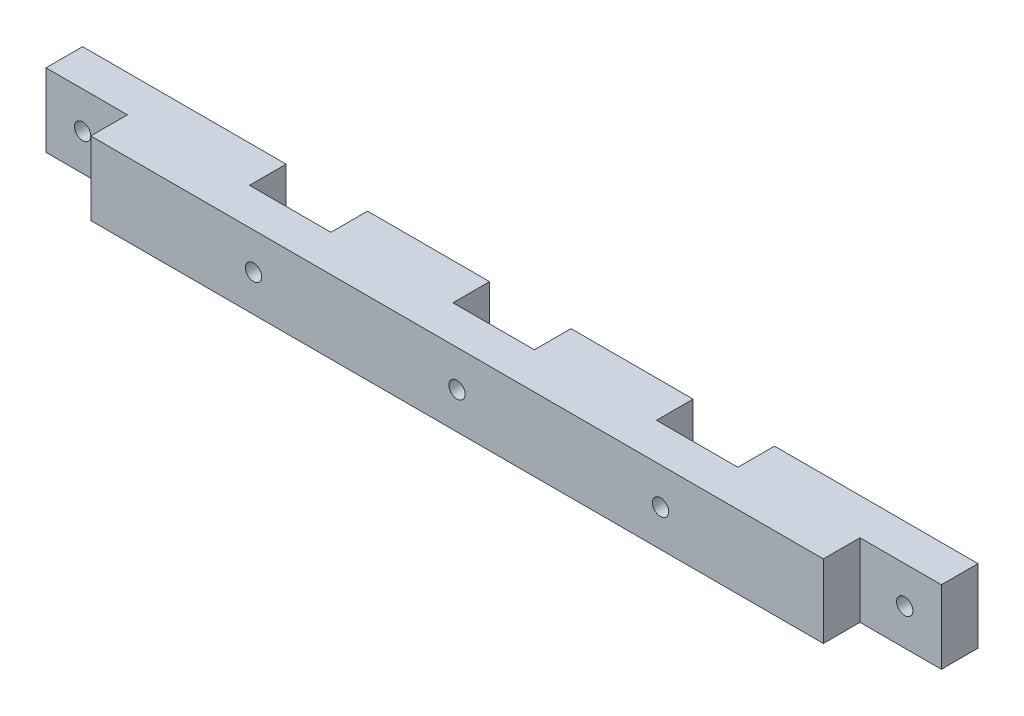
from build123d import *

# Parameters (mm, degrees)
ESQUISSE1_W             = 110
ESQUISSE1_H             = 9
EXTRUSION1_DEPTH        = 9
ESQUISSE2_W             = 10
ESQUISSE2_H             = 9
ENL_V_MAT_EXTRU_1_DEPTH = 4.5
ESQUISSE4_R             = 1
ENL_V_MAT_EXTRU_2_DEPTH = 4.5
ESQUISSE5_R             = 1
ENL_V_MAT_EXTRU_3_DEPTH = 4.5
ESQUISSE6_W             = 10
ESQUISSE6_H             = 9
ENL_V_MAT_EXTRU_4_DEPTH = 4.5
ESQUISSE7_R             = 1
ENL_V_MAT_EXTRU_5_DEPTH = 4.5


with BuildPart() as part:
    # Esquisse1 → Extrusion1 (new body)
    with BuildSketch(Plane.XY):
        with Locations((-12.271684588, -105.117562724)):
            Rectangle(ESQUISSE1_W, ESQUISSE1_H)
    extrude(amount=EXTRUSION1_DEPTH)

    # Esquisse2 → Enl_v. mat.-Extru.1 (cut)
    with BuildSketch(Plane.XY.offset(9)):
        with Locations((-62.271684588, -105.117562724)):
            Rectangle(ESQUISSE2_W, ESQUISSE2_H)
        with Locations((37.728315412, -105.117562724)):
            Rectangle(ESQUISSE2_W, ESQUISSE2_H)
    extrude(amount=-ENL_V_MAT_EXTRU_1_DEPTH, mode=Mode.SUBTRACT)

    # Esquisse4 → Enl_v. mat.-Extru.2 (cut)
    with BuildSketch(Plane.XY.offset(4.5)):
        with Locations((38.22840174, -105.145436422)):
            Circle(ESQUISSE4_R)
    extrude(amount=-ENL_V_MAT_EXTRU_2_DEPTH, mode=Mode.SUBTRACT)

    # Esquisse5 → Enl_v. mat.-Extru.3 (cut)
    with BuildSketch(Plane.XY.offset(4.5)):
        with Locations((-62.771684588, -105.117562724)):
            Circle(ESQUISSE5_R)
    extrude(amount=-ENL_V_MAT_EXTRU_3_DEPTH, mode=Mode.SUBTRACT)

    # Esquisse6 → Enl_v. mat.-Extru.4 (cut)
    with BuildSketch(Plane(origin=(0, 0, 0), x_dir=(-1, 0, 0), z_dir=(0, 0, -1))):
        with Locations((-12.728315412, -105.117562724)):
            Rectangle(ESQUISSE6_W, ESQUISSE6_H)
        with Locations((12.271684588, -105.117562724)):
            Rectangle(ESQUISSE6_W, ESQUISSE6_H)
        with Locations((37.271684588, -105.117562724)):
            Rectangle(ESQUISSE6_W, ESQUISSE6_H)
    extrude(amount=-ENL_V_MAT_EXTRU_4_DEPTH, mode=Mode.SUBTRACT)

    # Esquisse7 → Enl_v. mat.-Extru.5 (cut)
    with BuildSketch(Plane(origin=(0, 0, 4.5), x_dir=(-1, 0, 0), z_dir=(0, 0, -1))):
        with Locations((-12.728315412, -105.117562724)):
            Circle(ESQUISSE7_R)
        with Locations((12.271684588, -105.117562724)):
            Circle(ESQUISSE7_R)
        with Locations((37.271684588, -105.117562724)):
            Circle(ESQUISSE7_R)
    extrude(amount=-ENL_V_MAT_EXTRU_5_DEPTH, mode=Mode.SUBTRACT)


solid = part.part
